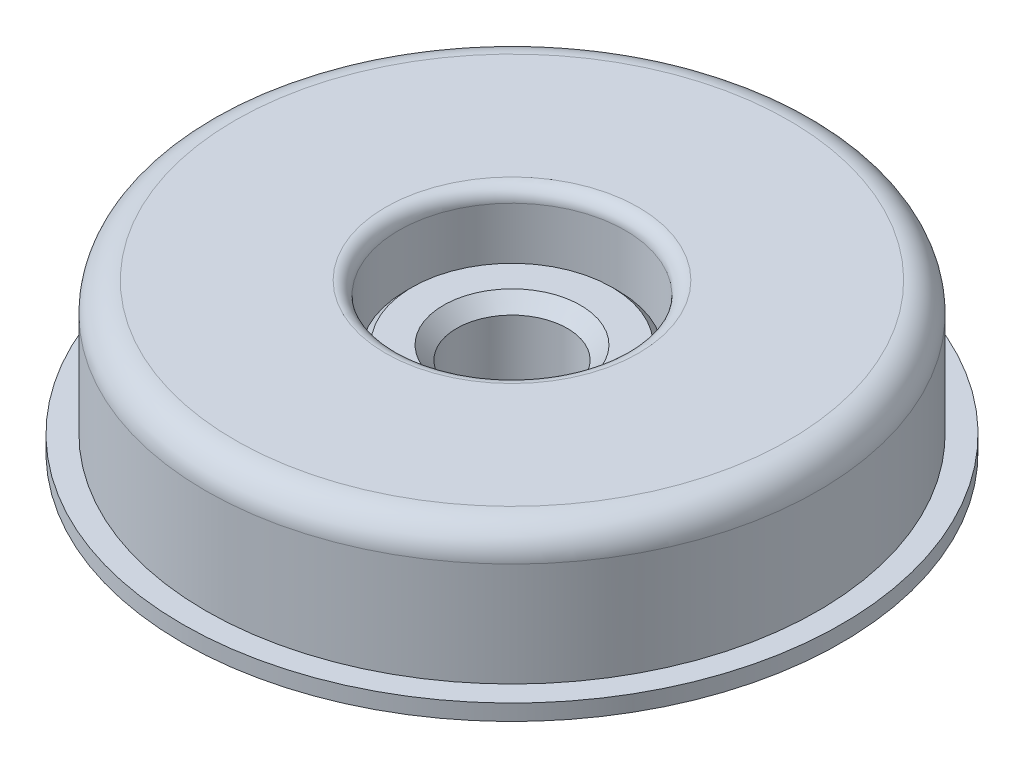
ISO-10303-21;
HEADER;
FILE_DESCRIPTION(('STEP AP214'),'2;1');
FILE_NAME('part.step','',(''),(''),'','','');
FILE_SCHEMA(('AUTOMOTIVE_DESIGN { 1 0 10303 214 1 1 1 1 }'));
ENDSEC;
DATA;
#1=APPLICATION_CONTEXT('core data for automotive mechanical design processes');
#2=APPLICATION_PROTOCOL_DEFINITION('international standard','automotive_design',2000,#1);
#3=PRODUCT_CONTEXT('',#1,'mechanical');
#4=PRODUCT('Part','Part','',(#3));
#5=PRODUCT_RELATED_PRODUCT_CATEGORY('part','',(#4));
#6=PRODUCT_DEFINITION_FORMATION('','',#4);
#7=PRODUCT_DEFINITION_CONTEXT('part definition',#1,'design');
#8=PRODUCT_DEFINITION('design','',#6,#7);
#9=PRODUCT_DEFINITION_SHAPE('','',#8);
#10=(LENGTH_UNIT() NAMED_UNIT(*) SI_UNIT(.MILLI.,.METRE.));
#11=(NAMED_UNIT(*) PLANE_ANGLE_UNIT() SI_UNIT($,.RADIAN.));
#12=(NAMED_UNIT(*) SI_UNIT($,.STERADIAN.) SOLID_ANGLE_UNIT());
#13=UNCERTAINTY_MEASURE_WITH_UNIT(LENGTH_MEASURE(1.E-05),#10,'distance_accuracy_value','');
#14=(GEOMETRIC_REPRESENTATION_CONTEXT(3) GLOBAL_UNCERTAINTY_ASSIGNED_CONTEXT((#13)) GLOBAL_UNIT_ASSIGNED_CONTEXT((#10,
#11,#12)) REPRESENTATION_CONTEXT('',''));
#15=CARTESIAN_POINT('',(0.,0.,0.));
#16=DIRECTION('',(0.,0.,1.));
#17=DIRECTION('',(1.,0.,0.));
#18=AXIS2_PLACEMENT_3D('',#15,#16,#17);
#19=CARTESIAN_POINT('',(0.,0.499999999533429,0.));
#20=DIRECTION('',(0.,-1.,0.));
#21=DIRECTION('',(0.,0.,-1.));
#22=AXIS2_PLACEMENT_3D('',#19,#20,#21);
#23=CONICAL_SURFACE('',#22,5.14999999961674,0.785398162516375);
#24=CARTESIAN_POINT('',(0.,0.499999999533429,0.));
#25=DIRECTION('',(0.,-1.,0.));
#26=DIRECTION('',(0.,0.,-1.));
#27=AXIS2_PLACEMENT_3D('',#24,#25,#26);
#28=CIRCLE('',#27,5.14999999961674);
#29=CARTESIAN_POINT('',(0.,0.499999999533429,-5.14999999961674));
#30=VERTEX_POINT('',#29);
#31=EDGE_CURVE('P0_E20',#30,#30,#28,.T.);
#32=ORIENTED_EDGE('',*,*,#31,.T.);
#33=EDGE_LOOP('',(#32));
#34=FACE_BOUND('',#33,.T.);
#35=CARTESIAN_POINT('',(0.,1.5,0.));
#36=DIRECTION('',(0.,1.,0.));
#37=DIRECTION('',(0.,0.,1.));
#38=AXIS2_PLACEMENT_3D('',#35,#36,#37);
#39=CIRCLE('',#38,4.15);
#40=CARTESIAN_POINT('',(0.,1.5,4.15));
#41=VERTEX_POINT('',#40);
#42=EDGE_CURVE('P0_E48',#41,#41,#39,.T.);
#43=ORIENTED_EDGE('',*,*,#42,.T.);
#44=EDGE_LOOP('',(#43));
#45=FACE_BOUND('',#44,.T.);
#46=ADVANCED_FACE('P0_F17',(#34,#45),#23,.F.);
#47=CARTESIAN_POINT('',(-4.575,0.5,0.));
#48=DIRECTION('',(0.,-1.,0.));
#49=DIRECTION('',(0.,0.,-1.));
#50=AXIS2_PLACEMENT_3D('',#47,#48,#49);
#51=PLANE('',#50);
#52=CARTESIAN_POINT('',(0.,0.5,0.));
#53=DIRECTION('',(0.,1.,0.));
#54=DIRECTION('',(0.,0.,1.));
#55=AXIS2_PLACEMENT_3D('',#52,#53,#54);
#56=CIRCLE('',#55,4.);
#57=CARTESIAN_POINT('',(0.,0.5,4.));
#58=VERTEX_POINT('',#57);
#59=EDGE_CURVE('P0_E45',#58,#58,#56,.F.);
#60=ORIENTED_EDGE('',*,*,#59,.T.);
#61=EDGE_LOOP('',(#60));
#62=FACE_BOUND('',#61,.T.);
#63=ORIENTED_EDGE('',*,*,#31,.F.);
#64=EDGE_LOOP('',(#63));
#65=FACE_BOUND('',#64,.T.);
#66=ADVANCED_FACE('P0_F65',(#62,#65),#51,.F.);
#67=CARTESIAN_POINT('',(0.,5.25,0.));
#68=DIRECTION('',(0.,1.,0.));
#69=DIRECTION('',(0.,0.,1.));
#70=AXIS2_PLACEMENT_3D('',#67,#68,#69);
#71=CYLINDRICAL_SURFACE('',#70,4.15);
#72=ORIENTED_EDGE('',*,*,#42,.F.);
#73=EDGE_LOOP('',(#72));
#74=FACE_BOUND('',#73,.T.);
#75=CARTESIAN_POINT('',(0.,8.9999999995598,0.));
#76=DIRECTION('',(0.,1.,0.));
#77=DIRECTION('',(-1.,0.,0.));
#78=AXIS2_PLACEMENT_3D('',#75,#76,#77);
#79=CIRCLE('',#78,4.15000000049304);
#80=CARTESIAN_POINT('',(-4.15000000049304,8.9999999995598,0.));
#81=VERTEX_POINT('',#80);
#82=EDGE_CURVE('P0_E41',#81,#81,#79,.T.);
#83=ORIENTED_EDGE('',*,*,#82,.T.);
#84=EDGE_LOOP('',(#83));
#85=FACE_BOUND('',#84,.T.);
#86=ADVANCED_FACE('P0_F71',(#74,#85),#71,.F.);
#87=CARTESIAN_POINT('',(0.,0.25,0.));
#88=DIRECTION('',(0.,1.,0.));
#89=DIRECTION('',(0.,0.,1.));
#90=AXIS2_PLACEMENT_3D('',#87,#88,#89);
#91=CYLINDRICAL_SURFACE('',#90,4.);
#92=CARTESIAN_POINT('',(0.,0.,0.));
#93=DIRECTION('',(0.,1.,0.));
#94=DIRECTION('',(0.,0.,1.));
#95=AXIS2_PLACEMENT_3D('',#92,#93,#94);
#96=CIRCLE('',#95,4.);
#97=CARTESIAN_POINT('',(0.,0.,4.));
#98=VERTEX_POINT('',#97);
#99=EDGE_CURVE('P0_E44',#98,#98,#96,.T.);
#100=ORIENTED_EDGE('',*,*,#99,.F.);
#101=EDGE_LOOP('',(#100));
#102=FACE_BOUND('',#101,.T.);
#103=ORIENTED_EDGE('',*,*,#59,.F.);
#104=EDGE_LOOP('',(#103));
#105=FACE_BOUND('',#104,.T.);
#106=ADVANCED_FACE('P0_F68',(#102,#105),#91,.F.);
#107=CARTESIAN_POINT('',(0.,10.0000000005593,0.));
#108=DIRECTION('',(0.,1.,0.));
#109=DIRECTION('',(0.,0.,1.));
#110=AXIS2_PLACEMENT_3D('',#107,#108,#109);
#111=CONICAL_SURFACE('',#110,5.14999999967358,0.785398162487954);
#112=ORIENTED_EDGE('',*,*,#82,.F.);
#113=EDGE_LOOP('',(#112));
#114=FACE_BOUND('',#113,.T.);
#115=CARTESIAN_POINT('',(0.,10.0000000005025,0.));
#116=DIRECTION('',(0.,1.,0.));
#117=DIRECTION('',(0.,0.,1.));
#118=AXIS2_PLACEMENT_3D('',#115,#116,#117);
#119=CIRCLE('',#118,5.14999999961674);
#120=CARTESIAN_POINT('',(0.,10.0000000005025,5.14999999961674));
#121=VERTEX_POINT('',#120);
#122=EDGE_CURVE('P0_E58',#121,#121,#119,.F.);
#123=ORIENTED_EDGE('',*,*,#122,.F.);
#124=EDGE_LOOP('',(#123));
#125=FACE_BOUND('',#124,.T.);
#126=ADVANCED_FACE('P0_F70',(#114,#125),#111,.F.);
#127=CARTESIAN_POINT('',(-3.75,0.,0.));
#128=DIRECTION('',(0.,-1.,0.));
#129=DIRECTION('',(0.,0.,-1.));
#130=AXIS2_PLACEMENT_3D('',#127,#128,#129);
#131=PLANE('',#130);
#132=ORIENTED_EDGE('',*,*,#99,.T.);
#133=EDGE_LOOP('',(#132));
#134=FACE_BOUND('',#133,.T.);
#135=CARTESIAN_POINT('',(0.,0.,0.));
#136=DIRECTION('',(0.,1.,0.));
#137=DIRECTION('',(0.,0.,1.));
#138=AXIS2_PLACEMENT_3D('',#135,#136,#137);
#139=CIRCLE('',#138,7.5);
#140=CARTESIAN_POINT('',(0.,0.,7.5));
#141=VERTEX_POINT('',#140);
#142=EDGE_CURVE('P0_E55',#141,#141,#139,.T.);
#143=ORIENTED_EDGE('',*,*,#142,.F.);
#144=EDGE_LOOP('',(#143));
#145=FACE_BOUND('',#144,.T.);
#146=ADVANCED_FACE('P0_F79',(#134,#145),#131,.T.);
#147=CARTESIAN_POINT('',(-3.75,10.,0.));
#148=DIRECTION('',(0.,1.,0.));
#149=DIRECTION('',(0.,0.,1.));
#150=AXIS2_PLACEMENT_3D('',#147,#148,#149);
#151=PLANE('',#150);
#152=ORIENTED_EDGE('',*,*,#122,.T.);
#153=EDGE_LOOP('',(#152));
#154=FACE_BOUND('',#153,.T.);
#155=CARTESIAN_POINT('',(0.,10.0000000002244,0.));
#156=DIRECTION('',(0.,-1.,0.));
#157=DIRECTION('',(0.,0.,-1.));
#158=AXIS2_PLACEMENT_3D('',#155,#156,#157);
#159=CIRCLE('',#158,7.50000000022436);
#160=CARTESIAN_POINT('',(0.,10.0000000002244,-7.50000000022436));
#161=VERTEX_POINT('',#160);
#162=EDGE_CURVE('P0_E38',#161,#161,#159,.T.);
#163=ORIENTED_EDGE('',*,*,#162,.F.);
#164=EDGE_LOOP('',(#163));
#165=FACE_BOUND('',#164,.T.);
#166=ADVANCED_FACE('P0_F103',(#154,#165),#151,.T.);
#167=CARTESIAN_POINT('',(0.,0.25,0.));
#168=DIRECTION('',(0.,1.,0.));
#169=DIRECTION('',(0.,0.,1.));
#170=AXIS2_PLACEMENT_3D('',#167,#168,#169);
#171=CYLINDRICAL_SURFACE('',#170,7.5);
#172=ORIENTED_EDGE('',*,*,#142,.T.);
#173=EDGE_LOOP('',(#172));
#174=FACE_BOUND('',#173,.T.);
#175=CARTESIAN_POINT('',(0.,0.499999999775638,0.));
#176=DIRECTION('',(0.,1.,0.));
#177=DIRECTION('',(-1.,0.,0.));
#178=AXIS2_PLACEMENT_3D('',#175,#176,#177);
#179=CIRCLE('',#178,7.50000000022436);
#180=CARTESIAN_POINT('',(-7.50000000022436,0.499999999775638,0.));
#181=VERTEX_POINT('',#180);
#182=EDGE_CURVE('P0_E29',#181,#181,#179,.T.);
#183=ORIENTED_EDGE('',*,*,#182,.F.);
#184=EDGE_LOOP('',(#183));
#185=FACE_BOUND('',#184,.T.);
#186=ADVANCED_FACE('P0_F99',(#174,#185),#171,.T.);
#187=CARTESIAN_POINT('',(0.,9.49999999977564,0.));
#188=DIRECTION('',(0.,-1.,0.));
#189=DIRECTION('',(0.,0.,-1.));
#190=AXIS2_PLACEMENT_3D('',#187,#188,#189);
#191=CONICAL_SURFACE('',#190,7.99999999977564,0.7853981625);
#192=CARTESIAN_POINT('',(0.,9.5,0.));
#193=DIRECTION('',(0.,1.,0.));
#194=DIRECTION('',(0.,0.,1.));
#195=AXIS2_PLACEMENT_3D('',#192,#193,#194);
#196=CIRCLE('',#195,8.);
#197=CARTESIAN_POINT('',(0.,9.5,8.));
#198=VERTEX_POINT('',#197);
#199=EDGE_CURVE('P0_E24',#198,#198,#196,.F.);
#200=ORIENTED_EDGE('',*,*,#199,.F.);
#201=EDGE_LOOP('',(#200));
#202=FACE_BOUND('',#201,.T.);
#203=ORIENTED_EDGE('',*,*,#162,.T.);
#204=EDGE_LOOP('',(#203));
#205=FACE_BOUND('',#204,.T.);
#206=ADVANCED_FACE('P0_F92',(#202,#205),#191,.T.);
#207=CARTESIAN_POINT('',(0.,1.00000000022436,0.));
#208=DIRECTION('',(0.,1.,0.));
#209=DIRECTION('',(0.,0.,1.));
#210=AXIS2_PLACEMENT_3D('',#207,#208,#209);
#211=CONICAL_SURFACE('',#210,7.99999999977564,0.7853981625);
#212=ORIENTED_EDGE('',*,*,#182,.T.);
#213=EDGE_LOOP('',(#212));
#214=FACE_BOUND('',#213,.T.);
#215=CARTESIAN_POINT('',(0.,1.,0.));
#216=DIRECTION('',(0.,1.,0.));
#217=DIRECTION('',(0.,0.,1.));
#218=AXIS2_PLACEMENT_3D('',#215,#216,#217);
#219=CIRCLE('',#218,8.);
#220=CARTESIAN_POINT('',(0.,1.,8.));
#221=VERTEX_POINT('',#220);
#222=EDGE_CURVE('P0_E10',#221,#221,#219,.T.);
#223=ORIENTED_EDGE('',*,*,#222,.F.);
#224=EDGE_LOOP('',(#223));
#225=FACE_BOUND('',#224,.T.);
#226=ADVANCED_FACE('P0_F87',(#214,#225),#211,.T.);
#227=CARTESIAN_POINT('',(0.,5.25,0.));
#228=DIRECTION('',(0.,1.,0.));
#229=DIRECTION('',(0.,0.,1.));
#230=AXIS2_PLACEMENT_3D('',#227,#228,#229);
#231=CYLINDRICAL_SURFACE('',#230,8.);
#232=ORIENTED_EDGE('',*,*,#222,.T.);
#233=EDGE_LOOP('',(#232));
#234=FACE_BOUND('',#233,.T.);
#235=ORIENTED_EDGE('',*,*,#199,.T.);
#236=EDGE_LOOP('',(#235));
#237=FACE_BOUND('',#236,.T.);
#238=ADVANCED_FACE('P0_F85',(#234,#237),#231,.T.);
#239=CLOSED_SHELL('',(#46,#66,#86,#106,#126,#146,#166,#186,#206,#226,#238));
#240=MANIFOLD_SOLID_BREP('P0_B1',#239);
#241=CARTESIAN_POINT('',(0.,8.,0.));
#242=DIRECTION('',(0.,1.,0.));
#243=DIRECTION('',(0.,0.,1.));
#244=AXIS2_PLACEMENT_3D('',#241,#242,#243);
#245=CYLINDRICAL_SURFACE('',#244,15.);
#246=CARTESIAN_POINT('',(0.,4.,0.));
#247=DIRECTION('',(0.,1.,0.));
#248=DIRECTION('',(-1.,0.,0.));
#249=AXIS2_PLACEMENT_3D('',#246,#247,#248);
#250=CIRCLE('',#249,15.);
#251=CARTESIAN_POINT('',(-15.,4.,0.));
#252=VERTEX_POINT('',#251);
#253=EDGE_CURVE('P1_E71',#252,#252,#250,.F.);
#254=ORIENTED_EDGE('',*,*,#253,.F.);
#255=EDGE_LOOP('',(#254));
#256=FACE_BOUND('',#255,.T.);
#257=CARTESIAN_POINT('',(0.,12.,0.));
#258=DIRECTION('',(0.,1.,0.));
#259=DIRECTION('',(0.,0.,1.));
#260=AXIS2_PLACEMENT_3D('',#257,#258,#259);
#261=CIRCLE('',#260,15.);
#262=CARTESIAN_POINT('',(0.,12.,15.));
#263=VERTEX_POINT('',#262);
#264=EDGE_CURVE('P1_E75',#263,#263,#261,.T.);
#265=ORIENTED_EDGE('',*,*,#264,.F.);
#266=EDGE_LOOP('',(#265));
#267=FACE_BOUND('',#266,.T.);
#268=ADVANCED_FACE('P1_F17',(#256,#267),#245,.T.);
#269=CARTESIAN_POINT('',(0.,12.,0.));
#270=DIRECTION('',(0.,1.,0.));
#271=DIRECTION('',(0.,0.,1.));
#272=AXIS2_PLACEMENT_3D('',#269,#270,#271);
#273=TOROIDAL_SURFACE('',#272,16.,0.999999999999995);
#274=ORIENTED_EDGE('',*,*,#264,.T.);
#275=EDGE_LOOP('',(#274));
#276=FACE_BOUND('',#275,.T.);
#277=CARTESIAN_POINT('',(0.,13.,0.));
#278=DIRECTION('',(0.,1.,0.));
#279=DIRECTION('',(0.,0.,1.));
#280=AXIS2_PLACEMENT_3D('',#277,#278,#279);
#281=CIRCLE('',#280,16.);
#282=CARTESIAN_POINT('',(0.,13.,16.));
#283=VERTEX_POINT('',#282);
#284=EDGE_CURVE('P1_E21',#283,#283,#281,.F.);
#285=ORIENTED_EDGE('',*,*,#284,.T.);
#286=EDGE_LOOP('',(#285));
#287=FACE_BOUND('',#286,.T.);
#288=ADVANCED_FACE('P1_F102',(#276,#287),#273,.F.);
#289=CARTESIAN_POINT('',(0.,4.,0.));
#290=DIRECTION('',(0.,1.,0.));
#291=DIRECTION('',(-1.,0.,0.));
#292=AXIS2_PLACEMENT_3D('',#289,#290,#291);
#293=TOROIDAL_SURFACE('',#292,14.,0.999999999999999);
#294=CARTESIAN_POINT('',(0.,3.,0.));
#295=DIRECTION('',(0.,1.,0.));
#296=DIRECTION('',(-1.,0.,0.));
#297=AXIS2_PLACEMENT_3D('',#294,#295,#296);
#298=CIRCLE('',#297,14.);
#299=CARTESIAN_POINT('',(-14.,3.,0.));
#300=VERTEX_POINT('',#299);
#301=EDGE_CURVE('P1_E60',#300,#300,#298,.F.);
#302=ORIENTED_EDGE('',*,*,#301,.F.);
#303=EDGE_LOOP('',(#302));
#304=FACE_BOUND('',#303,.T.);
#305=ORIENTED_EDGE('',*,*,#253,.T.);
#306=EDGE_LOOP('',(#305));
#307=FACE_BOUND('',#306,.T.);
#308=ADVANCED_FACE('P1_F91',(#304,#307),#293,.T.);
#309=CARTESIAN_POINT('',(-10.4,13.,0.));
#310=DIRECTION('',(0.,1.,0.));
#311=DIRECTION('',(0.,0.,1.));
#312=AXIS2_PLACEMENT_3D('',#309,#310,#311);
#313=PLANE('',#312);
#314=ORIENTED_EDGE('',*,*,#284,.F.);
#315=EDGE_LOOP('',(#314));
#316=FACE_BOUND('',#315,.T.);
#317=CARTESIAN_POINT('',(0.,13.,0.));
#318=DIRECTION('',(0.,1.,0.));
#319=DIRECTION('',(-1.,0.,0.));
#320=AXIS2_PLACEMENT_3D('',#317,#318,#319);
#321=CIRCLE('',#320,20.8);
#322=CARTESIAN_POINT('',(-20.8,13.,0.));
#323=VERTEX_POINT('',#322);
#324=EDGE_CURVE('P1_E51',#323,#323,#321,.F.);
#325=ORIENTED_EDGE('',*,*,#324,.T.);
#326=EDGE_LOOP('',(#325));
#327=FACE_BOUND('',#326,.T.);
#328=ADVANCED_FACE('P1_F101',(#316,#327),#313,.F.);
#329=CARTESIAN_POINT('',(-7.,3.,0.));
#330=DIRECTION('',(0.,-1.,0.));
#331=DIRECTION('',(0.,0.,-1.));
#332=AXIS2_PLACEMENT_3D('',#329,#330,#331);
#333=PLANE('',#332);
#334=CARTESIAN_POINT('',(0.,3.,0.));
#335=DIRECTION('',(0.,1.,0.));
#336=DIRECTION('',(0.,0.,1.));
#337=AXIS2_PLACEMENT_3D('',#334,#335,#336);
#338=CIRCLE('',#337,9.5);
#339=CARTESIAN_POINT('',(0.,3.,9.5));
#340=VERTEX_POINT('',#339);
#341=EDGE_CURVE('P1_E48',#340,#340,#338,.T.);
#342=ORIENTED_EDGE('',*,*,#341,.T.);
#343=EDGE_LOOP('',(#342));
#344=FACE_BOUND('',#343,.T.);
#345=ORIENTED_EDGE('',*,*,#301,.T.);
#346=EDGE_LOOP('',(#345));
#347=FACE_BOUND('',#346,.T.);
#348=ADVANCED_FACE('P1_F181',(#344,#347),#333,.T.);
#349=CARTESIAN_POINT('',(0.,12.,0.));
#350=DIRECTION('',(0.,1.,0.));
#351=DIRECTION('',(-1.,0.,0.));
#352=AXIS2_PLACEMENT_3D('',#349,#350,#351);
#353=TOROIDAL_SURFACE('',#352,20.8,1.);
#354=CARTESIAN_POINT('',(0.,12.,0.));
#355=DIRECTION('',(0.,1.,0.));
#356=DIRECTION('',(0.,0.,1.));
#357=AXIS2_PLACEMENT_3D('',#354,#355,#356);
#358=CIRCLE('',#357,21.8);
#359=CARTESIAN_POINT('',(0.,12.,21.8));
#360=VERTEX_POINT('',#359);
#361=EDGE_CURVE('P1_E50',#360,#360,#358,.F.);
#362=ORIENTED_EDGE('',*,*,#361,.T.);
#363=EDGE_LOOP('',(#362));
#364=FACE_BOUND('',#363,.T.);
#365=ORIENTED_EDGE('',*,*,#324,.F.);
#366=EDGE_LOOP('',(#365));
#367=FACE_BOUND('',#366,.T.);
#368=ADVANCED_FACE('P1_F114',(#364,#367),#353,.F.);
#369=CARTESIAN_POINT('',(0.,4.,0.));
#370=DIRECTION('',(0.,1.,0.));
#371=DIRECTION('',(0.,0.,1.));
#372=AXIS2_PLACEMENT_3D('',#369,#370,#371);
#373=TOROIDAL_SURFACE('',#372,9.5,0.999999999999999);
#374=ORIENTED_EDGE('',*,*,#341,.F.);
#375=EDGE_LOOP('',(#374));
#376=FACE_BOUND('',#375,.T.);
#377=CARTESIAN_POINT('',(0.,4.,0.));
#378=DIRECTION('',(0.,1.,0.));
#379=DIRECTION('',(0.,0.,1.));
#380=AXIS2_PLACEMENT_3D('',#377,#378,#379);
#381=CIRCLE('',#380,8.5);
#382=CARTESIAN_POINT('',(0.,4.,8.5));
#383=VERTEX_POINT('',#382);
#384=EDGE_CURVE('P1_E56',#383,#383,#381,.T.);
#385=ORIENTED_EDGE('',*,*,#384,.T.);
#386=EDGE_LOOP('',(#385));
#387=FACE_BOUND('',#386,.T.);
#388=ADVANCED_FACE('P1_F111',(#376,#387),#373,.T.);
#389=CARTESIAN_POINT('',(0.,8.25,0.));
#390=DIRECTION('',(0.,1.,0.));
#391=DIRECTION('',(0.,0.,1.));
#392=AXIS2_PLACEMENT_3D('',#389,#390,#391);
#393=CYLINDRICAL_SURFACE('',#392,21.8);
#394=CARTESIAN_POINT('',(0.,4.50000000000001,0.));
#395=DIRECTION('',(0.,-1.,0.));
#396=DIRECTION('',(0.,0.,-1.));
#397=AXIS2_PLACEMENT_3D('',#394,#395,#396);
#398=CIRCLE('',#397,21.8);
#399=CARTESIAN_POINT('',(0.,4.5,-21.8));
#400=VERTEX_POINT('',#399);
#401=EDGE_CURVE('P1_E217',#400,#400,#398,.T.);
#402=ORIENTED_EDGE('',*,*,#401,.T.);
#403=EDGE_LOOP('',(#402));
#404=FACE_BOUND('',#403,.T.);
#405=ORIENTED_EDGE('',*,*,#361,.F.);
#406=EDGE_LOOP('',(#405));
#407=FACE_BOUND('',#406,.T.);
#408=ADVANCED_FACE('P1_F113',(#404,#407),#393,.F.);
#409=CARTESIAN_POINT('',(0.,8.6,0.));
#410=DIRECTION('',(0.,1.,0.));
#411=DIRECTION('',(0.,0.,1.));
#412=AXIS2_PLACEMENT_3D('',#409,#410,#411);
#413=CYLINDRICAL_SURFACE('',#412,8.5);
#414=ORIENTED_EDGE('',*,*,#384,.F.);
#415=EDGE_LOOP('',(#414));
#416=FACE_BOUND('',#415,.T.);
#417=CARTESIAN_POINT('',(0.,13.2,0.));
#418=DIRECTION('',(0.,1.,0.));
#419=DIRECTION('',(0.,0.,1.));
#420=AXIS2_PLACEMENT_3D('',#417,#418,#419);
#421=CIRCLE('',#420,8.5);
#422=CARTESIAN_POINT('',(0.,13.2,8.5));
#423=VERTEX_POINT('',#422);
#424=EDGE_CURVE('P1_E47',#423,#423,#421,.T.);
#425=ORIENTED_EDGE('',*,*,#424,.T.);
#426=EDGE_LOOP('',(#425));
#427=FACE_BOUND('',#426,.T.);
#428=ADVANCED_FACE('P1_F118',(#416,#427),#413,.F.);
#429=CARTESIAN_POINT('',(0.,4.50000000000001,0.));
#430=DIRECTION('',(0.,1.,0.));
#431=DIRECTION('',(0.,0.,1.));
#432=AXIS2_PLACEMENT_3D('',#429,#430,#431);
#433=TOROIDAL_SURFACE('',#432,23.3,1.5);
#434=CARTESIAN_POINT('',(0.,3.,0.));
#435=DIRECTION('',(0.,1.,0.));
#436=DIRECTION('',(0.,0.,1.));
#437=AXIS2_PLACEMENT_3D('',#434,#435,#436);
#438=CIRCLE('',#437,23.3);
#439=CARTESIAN_POINT('',(0.,3.,23.3));
#440=VERTEX_POINT('',#439);
#441=EDGE_CURVE('P1_E45',#440,#440,#438,.T.);
#442=ORIENTED_EDGE('',*,*,#441,.F.);
#443=EDGE_LOOP('',(#442));
#444=FACE_BOUND('',#443,.T.);
#445=ORIENTED_EDGE('',*,*,#401,.F.);
#446=EDGE_LOOP('',(#445));
#447=FACE_BOUND('',#446,.T.);
#448=ADVANCED_FACE('P1_F116',(#444,#447),#433,.T.);
#449=CARTESIAN_POINT('',(0.,13.2,0.));
#450=DIRECTION('',(0.,1.,0.));
#451=DIRECTION('',(0.,0.,1.));
#452=AXIS2_PLACEMENT_3D('',#449,#450,#451);
#453=TOROIDAL_SURFACE('',#452,9.5,0.999999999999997);
#454=ORIENTED_EDGE('',*,*,#424,.F.);
#455=EDGE_LOOP('',(#454));
#456=FACE_BOUND('',#455,.T.);
#457=CARTESIAN_POINT('',(0.,14.2,0.));
#458=DIRECTION('',(0.,1.,0.));
#459=DIRECTION('',(0.,0.,1.));
#460=AXIS2_PLACEMENT_3D('',#457,#458,#459);
#461=CIRCLE('',#460,9.5);
#462=CARTESIAN_POINT('',(0.,14.2,9.5));
#463=VERTEX_POINT('',#462);
#464=EDGE_CURVE('P1_E42',#463,#463,#461,.F.);
#465=ORIENTED_EDGE('',*,*,#464,.F.);
#466=EDGE_LOOP('',(#465));
#467=FACE_BOUND('',#466,.T.);
#468=ADVANCED_FACE('P1_F19',(#456,#467),#453,.T.);
#469=CARTESIAN_POINT('',(-12.375,3.,0.));
#470=DIRECTION('',(0.,-1.,0.));
#471=DIRECTION('',(0.,0.,-1.));
#472=AXIS2_PLACEMENT_3D('',#469,#470,#471);
#473=PLANE('',#472);
#474=ORIENTED_EDGE('',*,*,#441,.T.);
#475=EDGE_LOOP('',(#474));
#476=FACE_BOUND('',#475,.T.);
#477=CARTESIAN_POINT('',(0.,3.,0.));
#478=DIRECTION('',(0.,1.,0.));
#479=DIRECTION('',(0.,0.,1.));
#480=AXIS2_PLACEMENT_3D('',#477,#478,#479);
#481=CIRCLE('',#480,24.75);
#482=CARTESIAN_POINT('',(0.,3.,24.75));
#483=VERTEX_POINT('',#482);
#484=EDGE_CURVE('P1_E39',#483,#483,#481,.T.);
#485=ORIENTED_EDGE('',*,*,#484,.F.);
#486=EDGE_LOOP('',(#485));
#487=FACE_BOUND('',#486,.T.);
#488=ADVANCED_FACE('P1_F125',(#476,#487),#473,.T.);
#489=CARTESIAN_POINT('',(-10.4,14.2,0.));
#490=DIRECTION('',(0.,1.,0.));
#491=DIRECTION('',(0.,0.,1.));
#492=AXIS2_PLACEMENT_3D('',#489,#490,#491);
#493=PLANE('',#492);
#494=ORIENTED_EDGE('',*,*,#464,.T.);
#495=EDGE_LOOP('',(#494));
#496=FACE_BOUND('',#495,.T.);
#497=CARTESIAN_POINT('',(0.,14.2,0.));
#498=DIRECTION('',(0.,-1.,0.));
#499=DIRECTION('',(-1.,0.,0.));
#500=AXIS2_PLACEMENT_3D('',#497,#498,#499);
#501=CIRCLE('',#500,20.8);
#502=CARTESIAN_POINT('',(-20.8,14.2,0.));
#503=VERTEX_POINT('',#502);
#504=EDGE_CURVE('P1_E38',#503,#503,#501,.T.);
#505=ORIENTED_EDGE('',*,*,#504,.F.);
#506=EDGE_LOOP('',(#505));
#507=FACE_BOUND('',#506,.T.);
#508=ADVANCED_FACE('P1_F162',(#496,#507),#493,.T.);
#509=CARTESIAN_POINT('',(0.,3.6,0.));
#510=DIRECTION('',(0.,1.,0.));
#511=DIRECTION('',(0.,0.,1.));
#512=AXIS2_PLACEMENT_3D('',#509,#510,#511);
#513=CYLINDRICAL_SURFACE('',#512,24.75);
#514=ORIENTED_EDGE('',*,*,#484,.T.);
#515=EDGE_LOOP('',(#514));
#516=FACE_BOUND('',#515,.T.);
#517=CARTESIAN_POINT('',(0.,4.2,0.));
#518=DIRECTION('',(0.,1.,0.));
#519=DIRECTION('',(0.,0.,1.));
#520=AXIS2_PLACEMENT_3D('',#517,#518,#519);
#521=CIRCLE('',#520,24.75);
#522=CARTESIAN_POINT('',(0.,4.2,24.75));
#523=VERTEX_POINT('',#522);
#524=EDGE_CURVE('P1_E30',#523,#523,#521,.T.);
#525=ORIENTED_EDGE('',*,*,#524,.F.);
#526=EDGE_LOOP('',(#525));
#527=FACE_BOUND('',#526,.T.);
#528=ADVANCED_FACE('P1_F147',(#516,#527),#513,.T.);
#529=CARTESIAN_POINT('',(0.,12.,0.));
#530=DIRECTION('',(0.,1.,0.));
#531=DIRECTION('',(-1.,0.,0.));
#532=AXIS2_PLACEMENT_3D('',#529,#530,#531);
#533=TOROIDAL_SURFACE('',#532,20.8,2.2);
#534=CARTESIAN_POINT('',(0.,12.,0.));
#535=DIRECTION('',(0.,1.,0.));
#536=DIRECTION('',(0.,0.,1.));
#537=AXIS2_PLACEMENT_3D('',#534,#535,#536);
#538=CIRCLE('',#537,23.);
#539=CARTESIAN_POINT('',(0.,12.,23.));
#540=VERTEX_POINT('',#539);
#541=EDGE_CURVE('P1_E25',#540,#540,#538,.F.);
#542=ORIENTED_EDGE('',*,*,#541,.F.);
#543=EDGE_LOOP('',(#542));
#544=FACE_BOUND('',#543,.T.);
#545=ORIENTED_EDGE('',*,*,#504,.T.);
#546=EDGE_LOOP('',(#545));
#547=FACE_BOUND('',#546,.T.);
#548=ADVANCED_FACE('P1_F138',(#544,#547),#533,.T.);
#549=CARTESIAN_POINT('',(-23.875,4.2,0.));
#550=DIRECTION('',(0.,1.,0.));
#551=DIRECTION('',(0.,0.,1.));
#552=AXIS2_PLACEMENT_3D('',#549,#550,#551);
#553=PLANE('',#552);
#554=CARTESIAN_POINT('',(0.,4.2,0.));
#555=DIRECTION('',(0.,1.,0.));
#556=DIRECTION('',(0.,0.,1.));
#557=AXIS2_PLACEMENT_3D('',#554,#555,#556);
#558=CIRCLE('',#557,23.);
#559=CARTESIAN_POINT('',(0.,4.2,23.));
#560=VERTEX_POINT('',#559);
#561=EDGE_CURVE('P1_E10',#560,#560,#558,.T.);
#562=ORIENTED_EDGE('',*,*,#561,.F.);
#563=EDGE_LOOP('',(#562));
#564=FACE_BOUND('',#563,.T.);
#565=ORIENTED_EDGE('',*,*,#524,.T.);
#566=EDGE_LOOP('',(#565));
#567=FACE_BOUND('',#566,.T.);
#568=ADVANCED_FACE('P1_F133',(#564,#567),#553,.T.);
#569=CARTESIAN_POINT('',(0.,8.1,0.));
#570=DIRECTION('',(0.,1.,0.));
#571=DIRECTION('',(0.,0.,1.));
#572=AXIS2_PLACEMENT_3D('',#569,#570,#571);
#573=CYLINDRICAL_SURFACE('',#572,23.);
#574=ORIENTED_EDGE('',*,*,#561,.T.);
#575=EDGE_LOOP('',(#574));
#576=FACE_BOUND('',#575,.T.);
#577=ORIENTED_EDGE('',*,*,#541,.T.);
#578=EDGE_LOOP('',(#577));
#579=FACE_BOUND('',#578,.T.);
#580=ADVANCED_FACE('P1_F131',(#576,#579),#573,.T.);
#581=CLOSED_SHELL('',(#268,#288,#308,#328,#348,#368,#388,#408,#428,#448,#468,#488,#508,#528,
#548,#568,#580));
#582=MANIFOLD_SOLID_BREP('P1_B1',#581);
#583=ADVANCED_BREP_SHAPE_REPRESENTATION('',(#18,#240,#582),#14);
#584=SHAPE_DEFINITION_REPRESENTATION(#9,#583);
ENDSEC;
END-ISO-10303-21;
